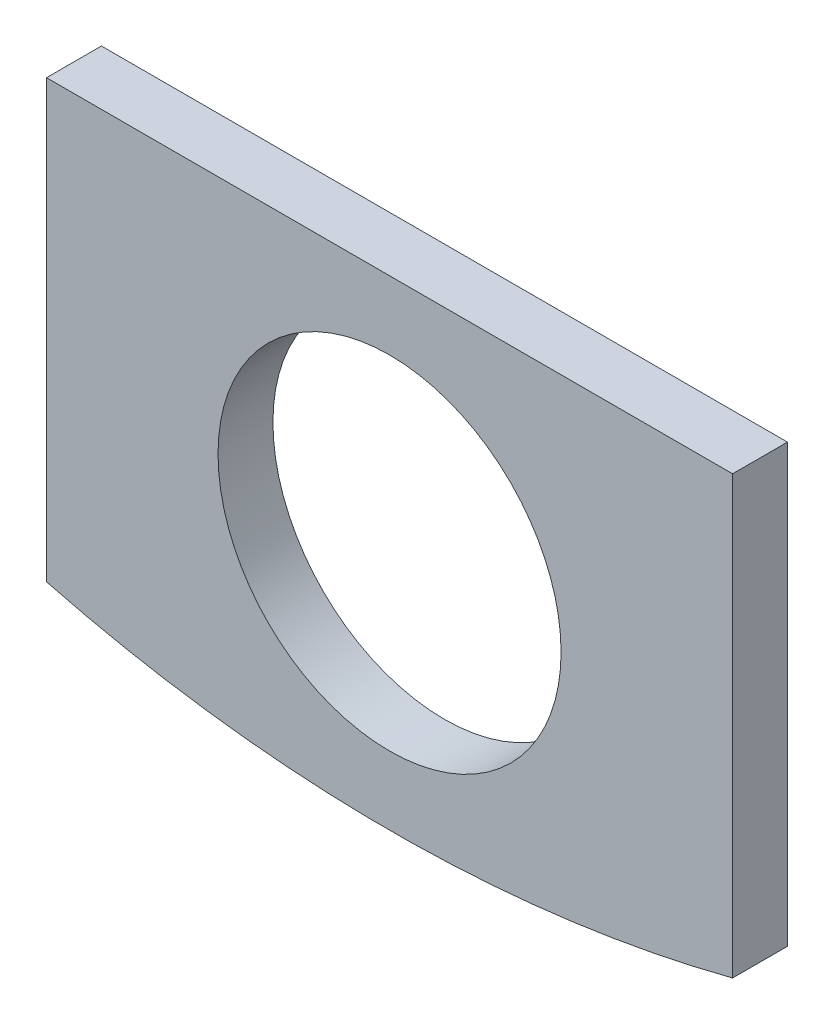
ISO-10303-21;
HEADER;
FILE_DESCRIPTION(('STEP AP214'),'2;1');
FILE_NAME('part.step','',(''),(''),'','','');
FILE_SCHEMA(('AUTOMOTIVE_DESIGN { 1 0 10303 214 1 1 1 1 }'));
ENDSEC;
DATA;
#1=APPLICATION_CONTEXT('core data for automotive mechanical design processes');
#2=APPLICATION_PROTOCOL_DEFINITION('international standard','automotive_design',2000,#1);
#3=PRODUCT_CONTEXT('',#1,'mechanical');
#4=PRODUCT('Part','Part','',(#3));
#5=PRODUCT_RELATED_PRODUCT_CATEGORY('part','',(#4));
#6=PRODUCT_DEFINITION_FORMATION('','',#4);
#7=PRODUCT_DEFINITION_CONTEXT('part definition',#1,'design');
#8=PRODUCT_DEFINITION('design','',#6,#7);
#9=PRODUCT_DEFINITION_SHAPE('','',#8);
#10=(LENGTH_UNIT() NAMED_UNIT(*) SI_UNIT(.MILLI.,.METRE.));
#11=(NAMED_UNIT(*) PLANE_ANGLE_UNIT() SI_UNIT($,.RADIAN.));
#12=(NAMED_UNIT(*) SI_UNIT($,.STERADIAN.) SOLID_ANGLE_UNIT());
#13=UNCERTAINTY_MEASURE_WITH_UNIT(LENGTH_MEASURE(1.E-05),#10,'distance_accuracy_value','');
#14=(GEOMETRIC_REPRESENTATION_CONTEXT(3) GLOBAL_UNCERTAINTY_ASSIGNED_CONTEXT((#13)) GLOBAL_UNIT_ASSIGNED_CONTEXT((#10,
#11,#12)) REPRESENTATION_CONTEXT('',''));
#15=CARTESIAN_POINT('',(0.,0.,0.));
#16=DIRECTION('',(0.,0.,1.));
#17=DIRECTION('',(1.,0.,0.));
#18=AXIS2_PLACEMENT_3D('',#15,#16,#17);
#19=CARTESIAN_POINT('',(25.,3.17541634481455,4.));
#20=DIRECTION('',(-1.,0.,0.));
#21=DIRECTION('',(0.,0.,1.));
#22=AXIS2_PLACEMENT_3D('',#19,#20,#21);
#23=PLANE('',#22);
#24=DIRECTION('',(0.,1.,0.));
#25=VECTOR('',#24,1.);
#26=CARTESIAN_POINT('',(25.,3.17541634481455,0.));
#27=LINE('',#26,#25);
#28=CARTESIAN_POINT('',(25.,3.17541634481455,0.));
#29=VERTEX_POINT('',#28);
#30=CARTESIAN_POINT('',(25.,35.,0.));
#31=VERTEX_POINT('',#30);
#32=EDGE_CURVE('E75',#29,#31,#27,.T.);
#33=ORIENTED_EDGE('',*,*,#32,.T.);
#34=DIRECTION('',(0.,0.,-1.));
#35=VECTOR('',#34,1.);
#36=CARTESIAN_POINT('',(25.,35.,4.));
#37=LINE('',#36,#35);
#38=CARTESIAN_POINT('',(25.,35.,4.));
#39=VERTEX_POINT('',#38);
#40=EDGE_CURVE('E11',#39,#31,#37,.T.);
#41=ORIENTED_EDGE('',*,*,#40,.F.);
#42=DIRECTION('',(0.,1.,0.));
#43=VECTOR('',#42,1.);
#44=CARTESIAN_POINT('',(25.,3.17541634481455,4.));
#45=LINE('',#44,#43);
#46=CARTESIAN_POINT('',(25.,3.17541634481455,4.));
#47=VERTEX_POINT('',#46);
#48=EDGE_CURVE('E98',#47,#39,#45,.T.);
#49=ORIENTED_EDGE('',*,*,#48,.F.);
#50=DIRECTION('',(0.,0.,-1.));
#51=VECTOR('',#50,1.);
#52=CARTESIAN_POINT('',(25.,3.17541634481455,4.));
#53=LINE('',#52,#51);
#54=EDGE_CURVE('E87',#47,#29,#53,.T.);
#55=ORIENTED_EDGE('',*,*,#54,.T.);
#56=EDGE_LOOP('',(#33,#41,#49,#55));
#57=FACE_BOUND('',#56,.T.);
#58=ADVANCED_FACE('F31',(#57),#23,.F.);
#59=CARTESIAN_POINT('',(-25.,35.,4.));
#60=DIRECTION('',(0.,-1.,0.));
#61=DIRECTION('',(0.,0.,-1.));
#62=AXIS2_PLACEMENT_3D('',#59,#60,#61);
#63=PLANE('',#62);
#64=DIRECTION('',(-1.,0.,0.));
#65=VECTOR('',#64,1.);
#66=CARTESIAN_POINT('',(-25.,35.,0.));
#67=LINE('',#66,#65);
#68=CARTESIAN_POINT('',(-25.,35.,0.));
#69=VERTEX_POINT('',#68);
#70=EDGE_CURVE('E71',#31,#69,#67,.T.);
#71=ORIENTED_EDGE('',*,*,#70,.T.);
#72=DIRECTION('',(0.,0.,-1.));
#73=VECTOR('',#72,1.);
#74=CARTESIAN_POINT('',(-25.,35.,4.));
#75=LINE('',#74,#73);
#76=CARTESIAN_POINT('',(-25.,35.,4.));
#77=VERTEX_POINT('',#76);
#78=EDGE_CURVE('E38',#77,#69,#75,.T.);
#79=ORIENTED_EDGE('',*,*,#78,.F.);
#80=DIRECTION('',(-1.,0.,0.));
#81=VECTOR('',#80,1.);
#82=CARTESIAN_POINT('',(-25.,35.,4.));
#83=LINE('',#82,#81);
#84=EDGE_CURVE('E83',#39,#77,#83,.T.);
#85=ORIENTED_EDGE('',*,*,#84,.F.);
#86=ORIENTED_EDGE('',*,*,#40,.T.);
#87=EDGE_LOOP('',(#71,#79,#85,#86));
#88=FACE_BOUND('',#87,.T.);
#89=ADVANCED_FACE('F82',(#88),#63,.F.);
#90=CARTESIAN_POINT('',(-25.,3.17541634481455,4.));
#91=DIRECTION('',(1.,0.,0.));
#92=DIRECTION('',(0.,0.,-1.));
#93=AXIS2_PLACEMENT_3D('',#90,#91,#92);
#94=PLANE('',#93);
#95=DIRECTION('',(0.,-1.,0.));
#96=VECTOR('',#95,1.);
#97=CARTESIAN_POINT('',(-25.,3.17541634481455,0.));
#98=LINE('',#97,#96);
#99=CARTESIAN_POINT('',(-25.,3.17541634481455,0.));
#100=VERTEX_POINT('',#99);
#101=EDGE_CURVE('E76',#69,#100,#98,.T.);
#102=ORIENTED_EDGE('',*,*,#101,.T.);
#103=DIRECTION('',(0.,0.,-1.));
#104=VECTOR('',#103,1.);
#105=CARTESIAN_POINT('',(-25.,3.17541634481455,4.));
#106=LINE('',#105,#104);
#107=CARTESIAN_POINT('',(-25.,3.17541634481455,4.));
#108=VERTEX_POINT('',#107);
#109=EDGE_CURVE('E104',#108,#100,#106,.T.);
#110=ORIENTED_EDGE('',*,*,#109,.F.);
#111=DIRECTION('',(0.,-1.,0.));
#112=VECTOR('',#111,1.);
#113=CARTESIAN_POINT('',(-25.,3.17541634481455,4.));
#114=LINE('',#113,#112);
#115=EDGE_CURVE('E50',#77,#108,#114,.T.);
#116=ORIENTED_EDGE('',*,*,#115,.F.);
#117=ORIENTED_EDGE('',*,*,#78,.T.);
#118=EDGE_LOOP('',(#102,#110,#116,#117));
#119=FACE_BOUND('',#118,.T.);
#120=ADVANCED_FACE('F107',(#119),#94,.F.);
#121=CARTESIAN_POINT('',(0.,100.,4.));
#122=DIRECTION('',(0.,0.,-1.));
#123=DIRECTION('',(-1.,0.,0.));
#124=AXIS2_PLACEMENT_3D('',#121,#122,#123);
#125=CYLINDRICAL_SURFACE('',#124,100.);
#126=CARTESIAN_POINT('',(0.,100.,0.));
#127=DIRECTION('',(0.,0.,1.));
#128=DIRECTION('',(1.,0.,0.));
#129=AXIS2_PLACEMENT_3D('',#126,#127,#128);
#130=CIRCLE('',#129,100.);
#131=EDGE_CURVE('E96',#100,#29,#130,.T.);
#132=ORIENTED_EDGE('',*,*,#131,.T.);
#133=ORIENTED_EDGE('',*,*,#54,.F.);
#134=CARTESIAN_POINT('',(0.,100.,4.));
#135=DIRECTION('',(0.,0.,1.));
#136=DIRECTION('',(1.,0.,0.));
#137=AXIS2_PLACEMENT_3D('',#134,#135,#136);
#138=CIRCLE('',#137,100.);
#139=EDGE_CURVE('E45',#108,#47,#138,.T.);
#140=ORIENTED_EDGE('',*,*,#139,.F.);
#141=ORIENTED_EDGE('',*,*,#109,.T.);
#142=EDGE_LOOP('',(#132,#133,#140,#141));
#143=FACE_BOUND('',#142,.T.);
#144=ADVANCED_FACE('F109',(#143),#125,.T.);
#145=CARTESIAN_POINT('',(0.,100.,4.));
#146=DIRECTION('',(0.,0.,1.));
#147=DIRECTION('',(1.,0.,0.));
#148=AXIS2_PLACEMENT_3D('',#145,#146,#147);
#149=PLANE('',#148);
#150=CARTESIAN_POINT('',(0.,17.5,4.));
#151=DIRECTION('',(0.,0.,1.));
#152=DIRECTION('',(1.,0.,0.));
#153=AXIS2_PLACEMENT_3D('',#150,#151,#152);
#154=CIRCLE('',#153,12.5);
#155=CARTESIAN_POINT('',(12.5,17.5,4.));
#156=VERTEX_POINT('',#155);
#157=EDGE_CURVE('E91',#156,#156,#154,.T.);
#158=ORIENTED_EDGE('',*,*,#157,.F.);
#159=EDGE_LOOP('',(#158));
#160=FACE_BOUND('',#159,.T.);
#161=ORIENTED_EDGE('',*,*,#48,.T.);
#162=ORIENTED_EDGE('',*,*,#84,.T.);
#163=ORIENTED_EDGE('',*,*,#115,.T.);
#164=ORIENTED_EDGE('',*,*,#139,.T.);
#165=EDGE_LOOP('',(#161,#162,#163,#164));
#166=FACE_BOUND('',#165,.T.);
#167=ADVANCED_FACE('F110',(#160,#166),#149,.T.);
#168=CARTESIAN_POINT('',(0.,100.,0.));
#169=DIRECTION('',(0.,0.,1.));
#170=DIRECTION('',(1.,0.,0.));
#171=AXIS2_PLACEMENT_3D('',#168,#169,#170);
#172=PLANE('',#171);
#173=CARTESIAN_POINT('',(0.,17.5,0.));
#174=DIRECTION('',(0.,0.,1.));
#175=DIRECTION('',(1.,0.,0.));
#176=AXIS2_PLACEMENT_3D('',#173,#174,#175);
#177=CIRCLE('',#176,12.5);
#178=CARTESIAN_POINT('',(12.5,17.5,0.));
#179=VERTEX_POINT('',#178);
#180=EDGE_CURVE('E88',#179,#179,#177,.T.);
#181=ORIENTED_EDGE('',*,*,#180,.T.);
#182=EDGE_LOOP('',(#181));
#183=FACE_BOUND('',#182,.T.);
#184=ORIENTED_EDGE('',*,*,#32,.F.);
#185=ORIENTED_EDGE('',*,*,#131,.F.);
#186=ORIENTED_EDGE('',*,*,#101,.F.);
#187=ORIENTED_EDGE('',*,*,#70,.F.);
#188=EDGE_LOOP('',(#184,#185,#186,#187));
#189=FACE_BOUND('',#188,.T.);
#190=ADVANCED_FACE('F72',(#183,#189),#172,.F.);
#191=CARTESIAN_POINT('',(0.,17.5,0.));
#192=DIRECTION('',(0.,0.,1.));
#193=DIRECTION('',(1.,0.,0.));
#194=AXIS2_PLACEMENT_3D('',#191,#192,#193);
#195=CYLINDRICAL_SURFACE('',#194,12.5);
#196=ORIENTED_EDGE('',*,*,#180,.F.);
#197=EDGE_LOOP('',(#196));
#198=FACE_BOUND('',#197,.T.);
#199=ORIENTED_EDGE('',*,*,#157,.T.);
#200=EDGE_LOOP('',(#199));
#201=FACE_BOUND('',#200,.T.);
#202=ADVANCED_FACE('F118',(#198,#201),#195,.F.);
#203=CLOSED_SHELL('',(#58,#89,#120,#144,#167,#190,#202));
#204=MANIFOLD_SOLID_BREP('B2',#203);
#205=ADVANCED_BREP_SHAPE_REPRESENTATION('',(#18,#204),#14);
#206=SHAPE_DEFINITION_REPRESENTATION(#9,#205);
ENDSEC;
END-ISO-10303-21;
